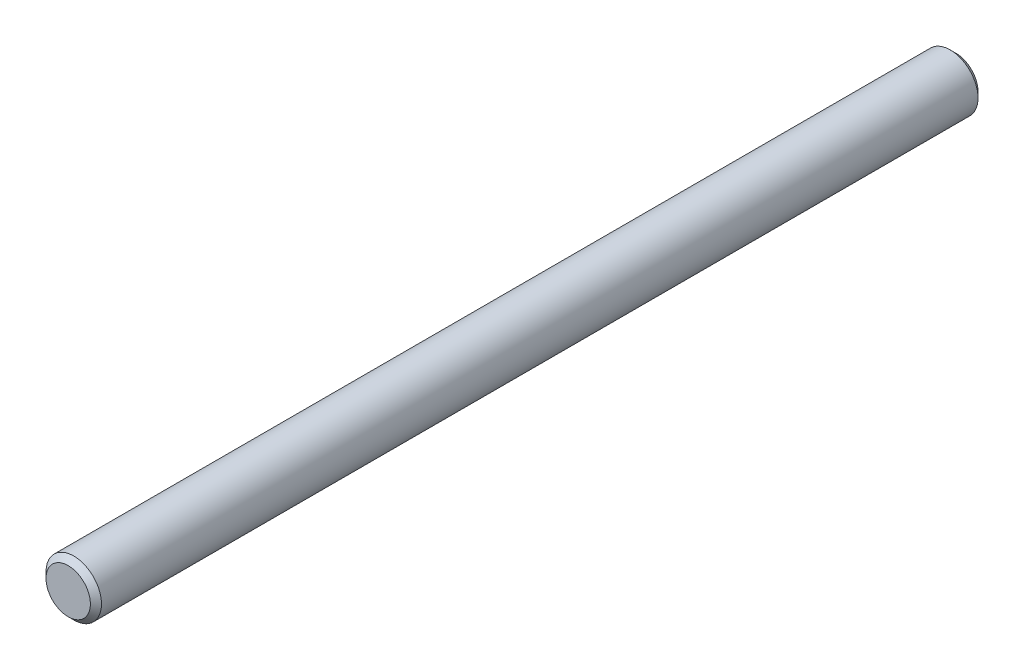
from build123d import *

# Parameters (mm, degrees)
SKETCH1_R      = 1.5875
EXTRUDE1_DEPTH = 25.4
CHAMFER1_SIZE  = 0.3175


with BuildPart() as part:
    # Sketch1 → Extrude1 (new, symmetric)
    with BuildSketch(Plane.XY):
        Circle(SKETCH1_R)
    extrude(amount=EXTRUDE1_DEPTH, both=True)

    # Chamfer1
    chamfer1_edges = [part.edges().sort_by_distance(p)[0] for p in [
        (-1.5875, 0, -25.4),
        (-1.5875, 0, 25.4),
    ]]
    chamfer(chamfer1_edges, length=CHAMFER1_SIZE)


solid = part.part
